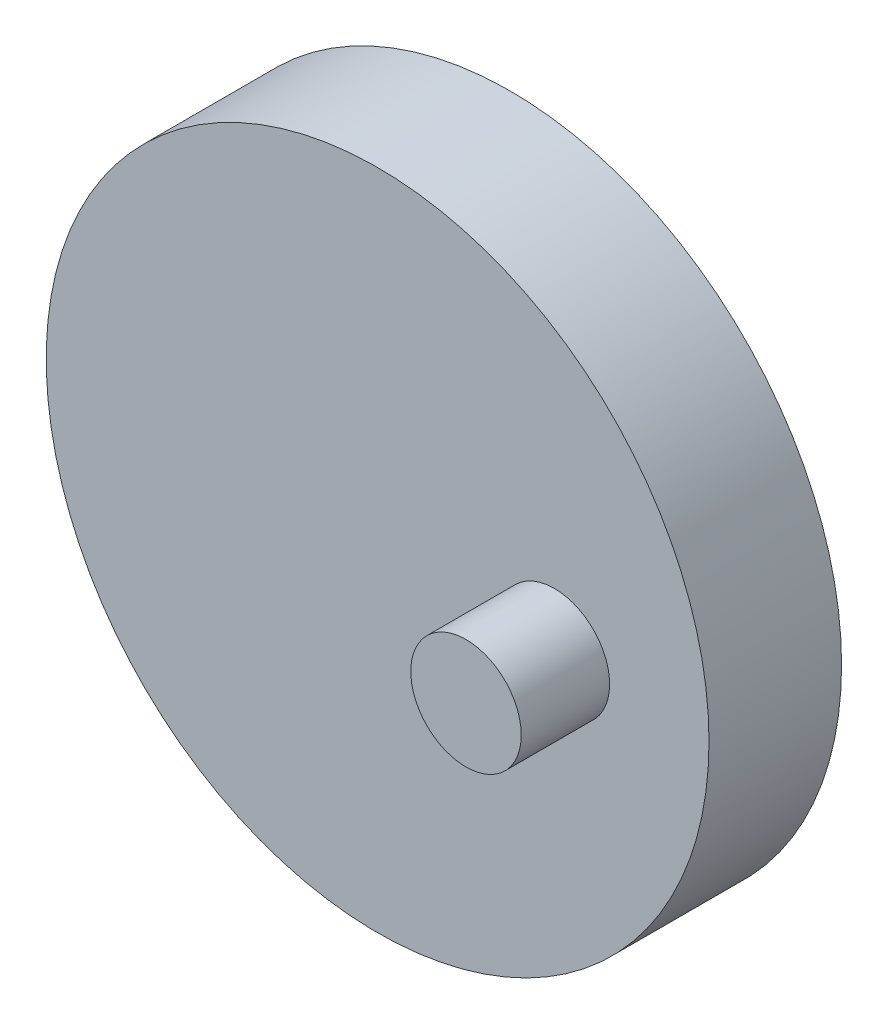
ISO-10303-21;
HEADER;
FILE_DESCRIPTION(('STEP AP214'),'2;1');
FILE_NAME('part.step','',(''),(''),'','','');
FILE_SCHEMA(('AUTOMOTIVE_DESIGN { 1 0 10303 214 1 1 1 1 }'));
ENDSEC;
DATA;
#1=APPLICATION_CONTEXT('core data for automotive mechanical design processes');
#2=APPLICATION_PROTOCOL_DEFINITION('international standard','automotive_design',2000,#1);
#3=PRODUCT_CONTEXT('',#1,'mechanical');
#4=PRODUCT('Part','Part','',(#3));
#5=PRODUCT_RELATED_PRODUCT_CATEGORY('part','',(#4));
#6=PRODUCT_DEFINITION_FORMATION('','',#4);
#7=PRODUCT_DEFINITION_CONTEXT('part definition',#1,'design');
#8=PRODUCT_DEFINITION('design','',#6,#7);
#9=PRODUCT_DEFINITION_SHAPE('','',#8);
#10=(LENGTH_UNIT() NAMED_UNIT(*) SI_UNIT(.MILLI.,.METRE.));
#11=(NAMED_UNIT(*) PLANE_ANGLE_UNIT() SI_UNIT($,.RADIAN.));
#12=(NAMED_UNIT(*) SI_UNIT($,.STERADIAN.) SOLID_ANGLE_UNIT());
#13=UNCERTAINTY_MEASURE_WITH_UNIT(LENGTH_MEASURE(1.E-05),#10,'distance_accuracy_value','');
#14=(GEOMETRIC_REPRESENTATION_CONTEXT(3) GLOBAL_UNCERTAINTY_ASSIGNED_CONTEXT((#13)) GLOBAL_UNIT_ASSIGNED_CONTEXT((#10,
#11,#12)) REPRESENTATION_CONTEXT('',''));
#15=CARTESIAN_POINT('',(0.,0.,0.));
#16=DIRECTION('',(0.,0.,1.));
#17=DIRECTION('',(1.,0.,0.));
#18=AXIS2_PLACEMENT_3D('',#15,#16,#17);
#19=CARTESIAN_POINT('',(715.,40.,30.));
#20=DIRECTION('',(0.,0.,1.));
#21=DIRECTION('',(1.,0.,0.));
#22=AXIS2_PLACEMENT_3D('',#19,#20,#21);
#23=PLANE('',#22);
#24=CARTESIAN_POINT('',(715.,40.,30.));
#25=DIRECTION('',(0.,0.,1.));
#26=DIRECTION('',(1.,0.,0.));
#27=AXIS2_PLACEMENT_3D('',#24,#25,#26);
#28=CIRCLE('',#27,74.9999999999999);
#29=CARTESIAN_POINT('',(790.,40.,30.));
#30=VERTEX_POINT('',#29);
#31=EDGE_CURVE('E44',#30,#30,#28,.T.);
#32=ORIENTED_EDGE('',*,*,#31,.T.);
#33=EDGE_LOOP('',(#32));
#34=FACE_BOUND('',#33,.T.);
#35=CARTESIAN_POINT('',(755.,40.,30.));
#36=DIRECTION('',(0.,0.,1.));
#37=DIRECTION('',(1.,0.,0.));
#38=AXIS2_PLACEMENT_3D('',#35,#36,#37);
#39=CIRCLE('',#38,12.5);
#40=CARTESIAN_POINT('',(767.5,40.,30.));
#41=VERTEX_POINT('',#40);
#42=EDGE_CURVE('E56',#41,#41,#39,.T.);
#43=ORIENTED_EDGE('',*,*,#42,.F.);
#44=EDGE_LOOP('',(#43));
#45=FACE_BOUND('',#44,.T.);
#46=ADVANCED_FACE('F33',(#34,#45),#23,.T.);
#47=CARTESIAN_POINT('',(715.,40.,-30.));
#48=DIRECTION('',(0.,0.,1.));
#49=DIRECTION('',(1.,0.,0.));
#50=AXIS2_PLACEMENT_3D('',#47,#48,#49);
#51=CYLINDRICAL_SURFACE('',#50,15.);
#52=CARTESIAN_POINT('',(715.,40.,-30.));
#53=DIRECTION('',(0.,0.,1.));
#54=DIRECTION('',(1.,0.,0.));
#55=AXIS2_PLACEMENT_3D('',#52,#53,#54);
#56=CIRCLE('',#55,15.);
#57=CARTESIAN_POINT('',(730.,40.,-30.));
#58=VERTEX_POINT('',#57);
#59=EDGE_CURVE('E10',#58,#58,#56,.T.);
#60=ORIENTED_EDGE('',*,*,#59,.T.);
#61=EDGE_LOOP('',(#60));
#62=FACE_BOUND('',#61,.T.);
#63=CARTESIAN_POINT('',(715.,40.,0.));
#64=DIRECTION('',(0.,0.,1.));
#65=DIRECTION('',(1.,0.,0.));
#66=AXIS2_PLACEMENT_3D('',#63,#64,#65);
#67=CIRCLE('',#66,15.);
#68=CARTESIAN_POINT('',(730.,40.,0.));
#69=VERTEX_POINT('',#68);
#70=EDGE_CURVE('E40',#69,#69,#67,.T.);
#71=ORIENTED_EDGE('',*,*,#70,.F.);
#72=EDGE_LOOP('',(#71));
#73=FACE_BOUND('',#72,.T.);
#74=ADVANCED_FACE('F35',(#62,#73),#51,.T.);
#75=CARTESIAN_POINT('',(715.,40.,-30.));
#76=DIRECTION('',(0.,0.,1.));
#77=DIRECTION('',(1.,0.,0.));
#78=AXIS2_PLACEMENT_3D('',#75,#76,#77);
#79=PLANE('',#78);
#80=ORIENTED_EDGE('',*,*,#59,.F.);
#81=EDGE_LOOP('',(#80));
#82=FACE_BOUND('',#81,.T.);
#83=ADVANCED_FACE('F68',(#82),#79,.F.);
#84=CARTESIAN_POINT('',(715.,40.,30.));
#85=DIRECTION('',(0.,0.,-1.));
#86=DIRECTION('',(-1.,0.,0.));
#87=AXIS2_PLACEMENT_3D('',#84,#85,#86);
#88=CYLINDRICAL_SURFACE('',#87,74.9999999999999);
#89=ORIENTED_EDGE('',*,*,#31,.F.);
#90=EDGE_LOOP('',(#89));
#91=FACE_BOUND('',#90,.T.);
#92=CARTESIAN_POINT('',(715.,40.,0.));
#93=DIRECTION('',(0.,0.,1.));
#94=DIRECTION('',(1.,0.,0.));
#95=AXIS2_PLACEMENT_3D('',#92,#93,#94);
#96=CIRCLE('',#95,74.9999999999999);
#97=CARTESIAN_POINT('',(790.,40.,0.));
#98=VERTEX_POINT('',#97);
#99=EDGE_CURVE('E48',#98,#98,#96,.T.);
#100=ORIENTED_EDGE('',*,*,#99,.T.);
#101=EDGE_LOOP('',(#100));
#102=FACE_BOUND('',#101,.T.);
#103=ADVANCED_FACE('F73',(#91,#102),#88,.T.);
#104=CARTESIAN_POINT('',(715.,40.,0.));
#105=DIRECTION('',(0.,0.,1.));
#106=DIRECTION('',(1.,0.,0.));
#107=AXIS2_PLACEMENT_3D('',#104,#105,#106);
#108=PLANE('',#107);
#109=ORIENTED_EDGE('',*,*,#70,.T.);
#110=EDGE_LOOP('',(#109));
#111=FACE_BOUND('',#110,.T.);
#112=ORIENTED_EDGE('',*,*,#99,.F.);
#113=EDGE_LOOP('',(#112));
#114=FACE_BOUND('',#113,.T.);
#115=ADVANCED_FACE('F71',(#111,#114),#108,.F.);
#116=CARTESIAN_POINT('',(755.,40.,50.));
#117=DIRECTION('',(0.,0.,-1.));
#118=DIRECTION('',(-1.,0.,0.));
#119=AXIS2_PLACEMENT_3D('',#116,#117,#118);
#120=CYLINDRICAL_SURFACE('',#119,12.5);
#121=CARTESIAN_POINT('',(755.,40.,50.));
#122=DIRECTION('',(0.,0.,1.));
#123=DIRECTION('',(1.,0.,0.));
#124=AXIS2_PLACEMENT_3D('',#121,#122,#123);
#125=CIRCLE('',#124,12.5);
#126=CARTESIAN_POINT('',(767.5,40.,50.));
#127=VERTEX_POINT('',#126);
#128=EDGE_CURVE('E53',#127,#127,#125,.T.);
#129=ORIENTED_EDGE('',*,*,#128,.F.);
#130=EDGE_LOOP('',(#129));
#131=FACE_BOUND('',#130,.T.);
#132=ORIENTED_EDGE('',*,*,#42,.T.);
#133=EDGE_LOOP('',(#132));
#134=FACE_BOUND('',#133,.T.);
#135=ADVANCED_FACE('F60',(#131,#134),#120,.T.);
#136=CARTESIAN_POINT('',(755.,40.,50.));
#137=DIRECTION('',(0.,0.,1.));
#138=DIRECTION('',(1.,0.,0.));
#139=AXIS2_PLACEMENT_3D('',#136,#137,#138);
#140=PLANE('',#139);
#141=ORIENTED_EDGE('',*,*,#128,.T.);
#142=EDGE_LOOP('',(#141));
#143=FACE_BOUND('',#142,.T.);
#144=ADVANCED_FACE('F98',(#143),#140,.T.);
#145=CLOSED_SHELL('',(#46,#74,#83,#103,#115,#135,#144));
#146=MANIFOLD_SOLID_BREP('B2',#145);
#147=ADVANCED_BREP_SHAPE_REPRESENTATION('',(#18,#146),#14);
#148=SHAPE_DEFINITION_REPRESENTATION(#9,#147);
ENDSEC;
END-ISO-10303-21;
